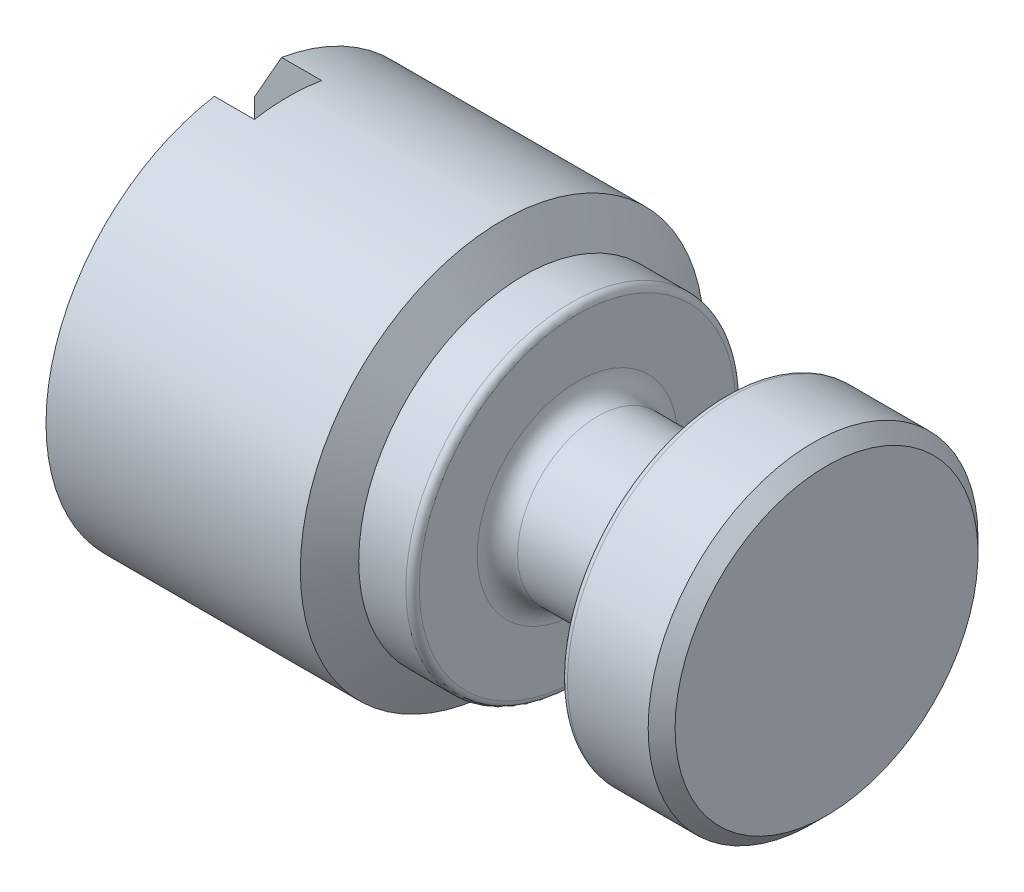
from build123d import *

# Parameters (mm, degrees)
CHANFREIN1_SIZE         = 0.2
CONG_1_R                = 0.3
ESQUISSE2_R             = 0.8
ESQUISSE4_W             = 1
ESQUISSE4_H             = 1
ENL_V_MAT_EXTRU_2_DEPTH = 4.5
CONG_2_R                = 0.1


with BuildPart() as part:
    # Esquisse1 → R_volution1 (revolve)
    with BuildSketch(Plane.XY, mode=Mode.PRIVATE) as r_volution1_sk:
        Polygon((0, 2.3), (0, 0), (9, 0), (9, 2.45), (7.5, 2.45), (7.5, 1.19), (5.3, 1.19), (5.3, 2.45), (4.5, 2.45), (4.182457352, 3), (0.404145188, 3), align=None)
    revolve(r_volution1_sk.sketch.rotate(Axis((-5.4550242, 0, 0), (1, 0, 0)), 90), axis=Axis((-5.4550242, 0, 0), (1, 0, 0)))

    # Chanfrein1
    chanfrein1_edges = [part.edges().sort_by_distance(p)[0] for p in [
        (9, 0, -2.45),
    ]]
    chamfer(chanfrein1_edges, length=CHANFREIN1_SIZE)

    # Cong_1
    cong_1_edges = [part.edges().sort_by_distance(p)[0] for p in [
        (5.3, 0, -1.19),
        (7.5, 0, -1.19),
    ]]
    fillet(cong_1_edges, radius=CONG_1_R)

    # Esquisse4 → Enl_v. mat.-Extru.2 (cut, symmetric)
    with BuildSketch(Plane(origin=(0, 0, 0), x_dir=(1, 0, 0), z_dir=(0, 1, 0))):
        with Locations((0.5, 0)):
            Rectangle(ESQUISSE4_W, ESQUISSE4_H)
    extrude(amount=ENL_V_MAT_EXTRU_2_DEPTH, both=True, mode=Mode.SUBTRACT)

    # Cong_2
    cong_2_edges = [part.edges().sort_by_distance(p)[0] for p in [
        (7.5, 0, -2.45),
        (5.3, 0, -2.45),
    ]]
    fillet(cong_2_edges, radius=CONG_2_R)


with BuildPart() as body_2:
    # Esquisse2 → R_volution2 (revolve)
    with BuildSketch(Plane.XY, mode=Mode.PRIVATE) as r_volution2_sk:
        with Locations((6.1, 1.9)):
            Circle(ESQUISSE2_R)
    revolve(r_volution2_sk.sketch.rotate(Axis((-5.4550242, 0, 0), (1, 0, 0)), 270), axis=Axis((-5.4550242, 0, 0), (1, 0, 0)))


solid = part.part
